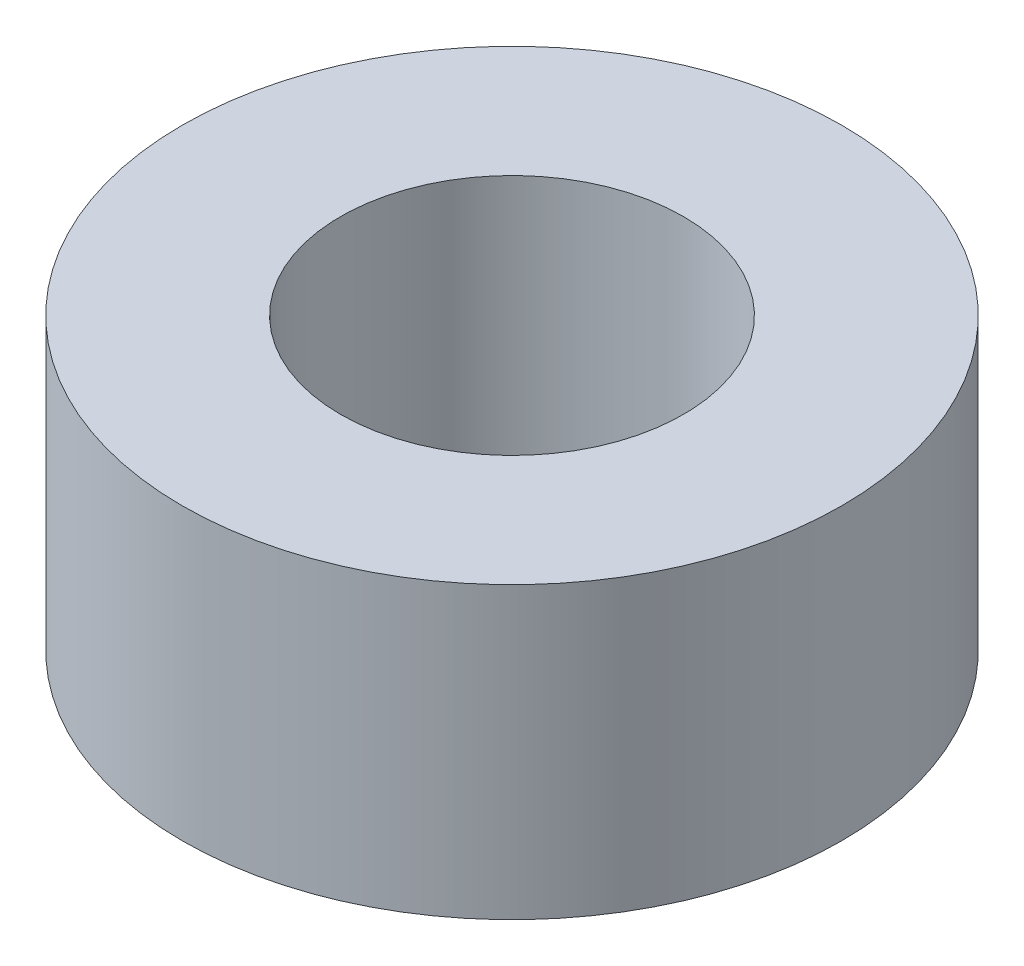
ISO-10303-21;
HEADER;
FILE_DESCRIPTION(('STEP AP214'),'2;1');
FILE_NAME('part.step','',(''),(''),'','','');
FILE_SCHEMA(('AUTOMOTIVE_DESIGN { 1 0 10303 214 1 1 1 1 }'));
ENDSEC;
DATA;
#1=APPLICATION_CONTEXT('core data for automotive mechanical design processes');
#2=APPLICATION_PROTOCOL_DEFINITION('international standard','automotive_design',2000,#1);
#3=PRODUCT_CONTEXT('',#1,'mechanical');
#4=PRODUCT('Part','Part','',(#3));
#5=PRODUCT_RELATED_PRODUCT_CATEGORY('part','',(#4));
#6=PRODUCT_DEFINITION_FORMATION('','',#4);
#7=PRODUCT_DEFINITION_CONTEXT('part definition',#1,'design');
#8=PRODUCT_DEFINITION('design','',#6,#7);
#9=PRODUCT_DEFINITION_SHAPE('','',#8);
#10=(LENGTH_UNIT() NAMED_UNIT(*) SI_UNIT(.MILLI.,.METRE.));
#11=(NAMED_UNIT(*) PLANE_ANGLE_UNIT() SI_UNIT($,.RADIAN.));
#12=(NAMED_UNIT(*) SI_UNIT($,.STERADIAN.) SOLID_ANGLE_UNIT());
#13=UNCERTAINTY_MEASURE_WITH_UNIT(LENGTH_MEASURE(1.E-05),#10,'distance_accuracy_value','');
#14=(GEOMETRIC_REPRESENTATION_CONTEXT(3) GLOBAL_UNCERTAINTY_ASSIGNED_CONTEXT((#13)) GLOBAL_UNIT_ASSIGNED_CONTEXT((#10,
#11,#12)) REPRESENTATION_CONTEXT('',''));
#15=CARTESIAN_POINT('',(0.,0.,0.));
#16=DIRECTION('',(0.,0.,1.));
#17=DIRECTION('',(1.,0.,0.));
#18=AXIS2_PLACEMENT_3D('',#15,#16,#17);
#19=CARTESIAN_POINT('',(0.,1.397,0.));
#20=DIRECTION('',(0.,1.,0.));
#21=DIRECTION('',(0.,0.,1.));
#22=AXIS2_PLACEMENT_3D('',#19,#20,#21);
#23=PLANE('',#22);
#24=CARTESIAN_POINT('',(0.,1.397,0.));
#25=DIRECTION('',(0.,1.,0.));
#26=DIRECTION('',(0.,0.,1.));
#27=AXIS2_PLACEMENT_3D('',#24,#25,#26);
#28=CIRCLE('',#27,3.175);
#29=CARTESIAN_POINT('',(0.,1.397,3.175));
#30=VERTEX_POINT('',#29);
#31=EDGE_CURVE('E10',#30,#30,#28,.T.);
#32=ORIENTED_EDGE('',*,*,#31,.T.);
#33=EDGE_LOOP('',(#32));
#34=FACE_BOUND('',#33,.T.);
#35=CARTESIAN_POINT('',(0.,1.397,0.));
#36=DIRECTION('',(0.,1.,0.));
#37=DIRECTION('',(0.,0.,1.));
#38=AXIS2_PLACEMENT_3D('',#35,#36,#37);
#39=CIRCLE('',#38,1.651);
#40=CARTESIAN_POINT('',(0.,1.397,1.651));
#41=VERTEX_POINT('',#40);
#42=EDGE_CURVE('E40',#41,#41,#39,.T.);
#43=ORIENTED_EDGE('',*,*,#42,.F.);
#44=EDGE_LOOP('',(#43));
#45=FACE_BOUND('',#44,.T.);
#46=ADVANCED_FACE('F29',(#34,#45),#23,.T.);
#47=CARTESIAN_POINT('',(0.,-1.397,0.));
#48=DIRECTION('',(0.,1.,0.));
#49=DIRECTION('',(0.,0.,1.));
#50=AXIS2_PLACEMENT_3D('',#47,#48,#49);
#51=PLANE('',#50);
#52=CARTESIAN_POINT('',(0.,-1.397,0.));
#53=DIRECTION('',(0.,1.,0.));
#54=DIRECTION('',(0.,0.,1.));
#55=AXIS2_PLACEMENT_3D('',#52,#53,#54);
#56=CIRCLE('',#55,3.175);
#57=CARTESIAN_POINT('',(0.,-1.397,3.175));
#58=VERTEX_POINT('',#57);
#59=EDGE_CURVE('E36',#58,#58,#56,.T.);
#60=ORIENTED_EDGE('',*,*,#59,.F.);
#61=EDGE_LOOP('',(#60));
#62=FACE_BOUND('',#61,.T.);
#63=CARTESIAN_POINT('',(0.,-1.397,0.));
#64=DIRECTION('',(0.,1.,0.));
#65=DIRECTION('',(0.,0.,1.));
#66=AXIS2_PLACEMENT_3D('',#63,#64,#65);
#67=CIRCLE('',#66,1.651);
#68=CARTESIAN_POINT('',(0.,-1.397,1.651));
#69=VERTEX_POINT('',#68);
#70=EDGE_CURVE('E44',#69,#69,#67,.T.);
#71=ORIENTED_EDGE('',*,*,#70,.T.);
#72=EDGE_LOOP('',(#71));
#73=FACE_BOUND('',#72,.T.);
#74=ADVANCED_FACE('F50',(#62,#73),#51,.F.);
#75=CARTESIAN_POINT('',(0.,1.397,0.));
#76=DIRECTION('',(0.,-1.,0.));
#77=DIRECTION('',(0.,0.,-1.));
#78=AXIS2_PLACEMENT_3D('',#75,#76,#77);
#79=CYLINDRICAL_SURFACE('',#78,3.175);
#80=ORIENTED_EDGE('',*,*,#31,.F.);
#81=EDGE_LOOP('',(#80));
#82=FACE_BOUND('',#81,.T.);
#83=ORIENTED_EDGE('',*,*,#59,.T.);
#84=EDGE_LOOP('',(#83));
#85=FACE_BOUND('',#84,.T.);
#86=ADVANCED_FACE('F31',(#82,#85),#79,.T.);
#87=CARTESIAN_POINT('',(0.,1.397,0.));
#88=DIRECTION('',(0.,-1.,0.));
#89=DIRECTION('',(0.,0.,-1.));
#90=AXIS2_PLACEMENT_3D('',#87,#88,#89);
#91=CYLINDRICAL_SURFACE('',#90,1.651);
#92=ORIENTED_EDGE('',*,*,#42,.T.);
#93=EDGE_LOOP('',(#92));
#94=FACE_BOUND('',#93,.T.);
#95=ORIENTED_EDGE('',*,*,#70,.F.);
#96=EDGE_LOOP('',(#95));
#97=FACE_BOUND('',#96,.T.);
#98=ADVANCED_FACE('F52',(#94,#97),#91,.F.);
#99=CLOSED_SHELL('',(#46,#74,#86,#98));
#100=MANIFOLD_SOLID_BREP('B2',#99);
#101=ADVANCED_BREP_SHAPE_REPRESENTATION('',(#18,#100),#14);
#102=SHAPE_DEFINITION_REPRESENTATION(#9,#101);
ENDSEC;
END-ISO-10303-21;
